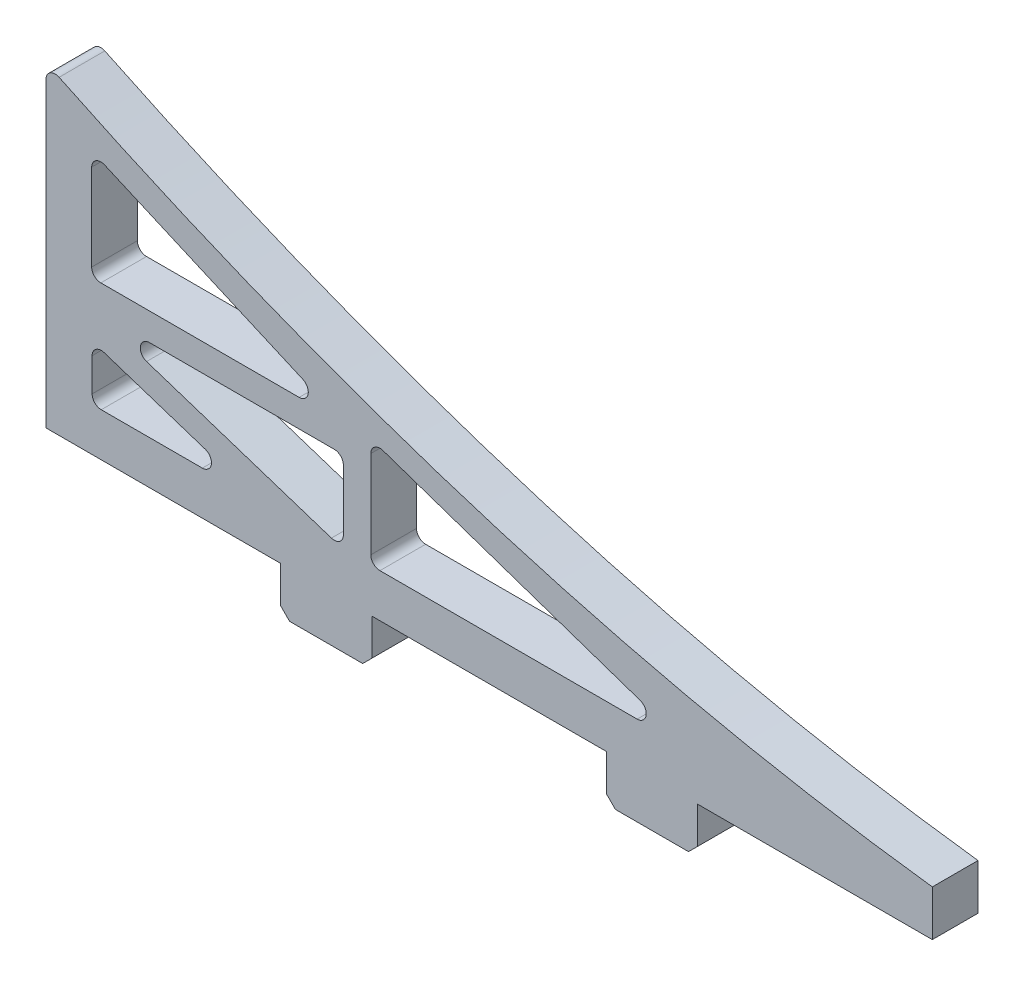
from build123d import *

# Parameters (mm, degrees)
BOSS_EXTRU_1_DEPTH      = 5
ESQUISSE3_W             = 10
ESQUISSE3_H             = 5
BOSS_EXTRU_2_DEPTH      = 5
CONG_1_R                = 1
ENL_V_MAT_EXTRU_1_DEPTH = 5
CONG_2_R                = 1
CONG_3_R                = 1
CONG_4_R                = 1
CHANFREIN1_SIZE         = 1
CHANFREIN2_SIZE         = 1


with BuildPart() as part:
    # Esquisse1 → Boss.-Extru.1 (new body)
    with BuildSketch(Plane.XY):
        with BuildLine():
            Line((-16.66, 2.041875), (-16.66, -2.958125))
            Line((-16.66, -2.958125), (-113.659999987, -2.958125))
            Line((-113.659999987, -2.958125), (-113.659999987, 31.687499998))
            add(Edge.make_bspline(
                [(-113.659999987, 31.687499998), (-65.159999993, 8.043750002), (-16.66, 2.041875)],
                knots=[0.078722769, 0.078722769, 0.078722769, 0.916247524, 0.916247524, 0.916247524], degree=2))
        make_face()
    extrude(amount=BOSS_EXTRU_1_DEPTH)

    # Esquisse3 → Boss.-Extru.2 (add)
    with BuildSketch(Plane.XZ.offset(2.958125)):
        with Locations((-82.999999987, 2.5)):
            Rectangle(ESQUISSE3_W, ESQUISSE3_H)
        with Locations((-47.339999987, 2.5)):
            Rectangle(ESQUISSE3_W, ESQUISSE3_H)
    extrude(amount=BOSS_EXTRU_2_DEPTH)

    # Cong_1
    cong_1_edges = [part.edges().sort_by_distance(p)[0] for p in [
        (-113.659999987, 31.687499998, 2.5),
    ]]
    fillet(cong_1_edges, radius=CONG_1_R)

    # Esquisse4 → Enl_v. mat.-Extru.1 (cut)
    with BuildSketch(Plane.XY.offset(5)):
        Polygon((-108.659999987, 25.791140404), (-108.659999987, 13.791140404), (-81.164545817, 13.791140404), align=None)
        Polygon((-108.612857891, 10.791140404), (-81.112857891, 10.791140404), (-81.112857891, 1.791140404), align=None)
        Polygon((-108.612857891, 7.791140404), (-108.612857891, 1.791140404), (-90.279524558, 1.791140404), align=None)
        Polygon((-78.112857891, 13.791140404), (-78.112857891, 1.791140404), (-42.939159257, 1.791140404), align=None)
    extrude(amount=-ENL_V_MAT_EXTRU_1_DEPTH, mode=Mode.SUBTRACT)

    # Cong_2
    cong_2_edges = [part.edges().sort_by_distance(p)[0] for p in [
        (-81.164545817, 13.791140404, 2.5),
    ]]
    fillet(cong_2_edges, radius=CONG_2_R)

    # Cong_3
    cong_3_edges = [part.edges().sort_by_distance(p)[0] for p in [
        (-108.659999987, 25.791140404, 2.5),
        (-108.659999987, 13.791140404, 2.5),
    ]]
    fillet(cong_3_edges, radius=CONG_3_R)

    # Cong_4
    cong_4_edges = [part.edges().sort_by_distance(p)[0] for p in [
        (-78.112857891, 13.791140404, 2.5),
        (-42.939159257, 1.791140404, 2.5),
        (-78.112857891, 1.791140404, 2.5),
        (-81.112857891, 1.791140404, 2.5),
        (-108.612857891, 10.791140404, 2.5),
        (-81.112857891, 10.791140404, 2.5),
        (-108.612857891, 7.791140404, 2.5),
        (-90.279524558, 1.791140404, 2.5),
        (-108.612857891, 1.791140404, 2.5),
    ]]
    fillet(cong_4_edges, radius=CONG_4_R)

    # Chanfrein1
    chanfrein1_edges = [part.edges().sort_by_distance(p)[0] for p in [
        (-87.999999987, -7.958125, 2.5),
        (-77.999999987, -7.958125, 2.5),
    ]]
    chamfer(chanfrein1_edges, length=CHANFREIN1_SIZE)

    # Chanfrein2
    chanfrein2_edges = [part.edges().sort_by_distance(p)[0] for p in [
        (-52.339999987, -7.958125, 2.5),
        (-42.339999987, -7.958125, 2.5),
    ]]
    chamfer(chanfrein2_edges, length=CHANFREIN2_SIZE)


solid = part.part
